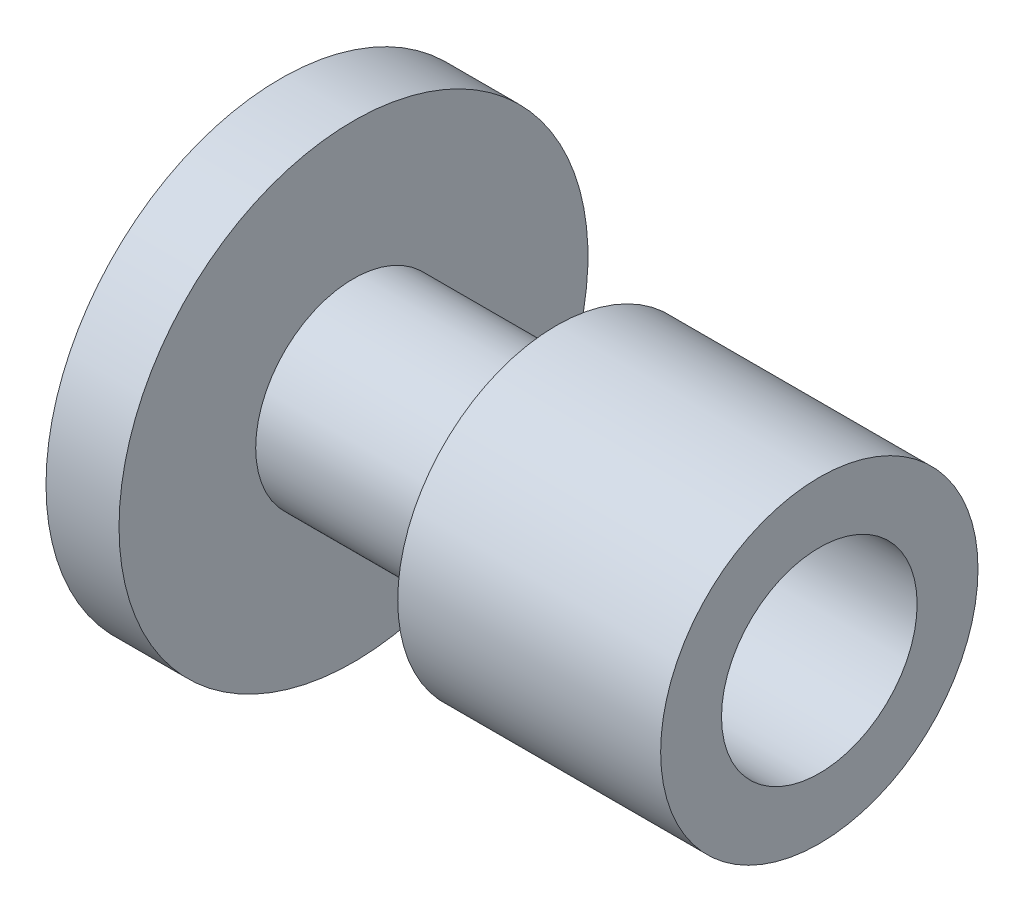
from build123d import *


with BuildPart() as part:
    # Sketch1 → Revolve1 (revolve)
    with BuildSketch(Plane.XY, mode=Mode.PRIVATE) as revolve1_sk:
        Polygon((0, 0), (0, 30.352975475), (9.453412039, 30.352975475), (9.453412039, 12.663163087), (35.721009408, 12.663163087), (35.721009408, 20.540657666), (69.756068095, 20.540657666), (69.756068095, 12.663163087), (46.123584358, 12.663163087), (46.123584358, 9.518528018), (7.547489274, 9.518528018), (7.547489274, 0), align=None)
    revolve(revolve1_sk.sketch.rotate(Axis((0, 0, 0), (1, 0, 0)), 90), axis=Axis((0, 0, 0), (1, 0, 0)))


solid = part.part
